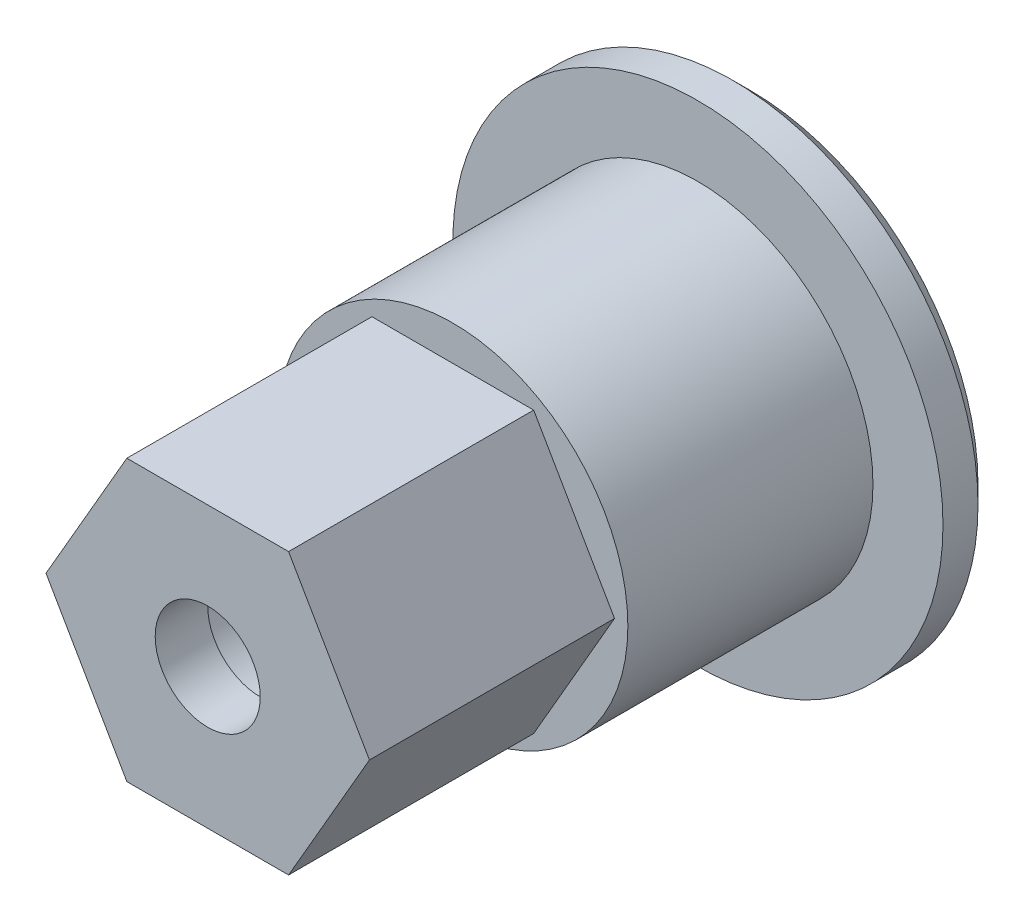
from build123d import *

# Parameters (mm, degrees)
ESQUISSE2_R             = 14
ESQUISSE2_R_2           = 3
RONDIN_28_PERC_6_DEPTH  = 31
ESQUISSE3_OUTSIDE_W     = 40.058
ESQUISSE3_OUTSIDE_H     = 40.058
ESQUISSE3_OUTSIDE_R     = 10
CHARIOTAGE_20_DEPTH     = 28
ESQUISSE5_OUTSIDE_W     = 40.058
ESQUISSE5_OUTSIDE_H     = 40.058
HEXAGONE_DEPTH          = 14
ESQUISSE6_R             = 4.05
ENL_V_MAT_EXTRU_4_DEPTH = 28
CHANFREIN1_SIZE         = 1


with BuildPart() as part:
    # Esquisse2 → rondin 28 perc_ 6 (new body)
    with BuildSketch(Plane.XY):
        Circle(ESQUISSE2_R)
        with Locations(Location((0, 0, 0), (0, 0, 180))):
            Circle(ESQUISSE2_R_2, mode=Mode.SUBTRACT)
    extrude(amount=RONDIN_28_PERC_6_DEPTH)

    # Esquisse3 outside → chariotage 20 (cut)
    with BuildSketch(Plane.XY.offset(31)):
        Rectangle(ESQUISSE3_OUTSIDE_W, ESQUISSE3_OUTSIDE_H)
        Circle(ESQUISSE3_OUTSIDE_R, mode=Mode.SUBTRACT)
    extrude(amount=-CHARIOTAGE_20_DEPTH, mode=Mode.SUBTRACT)

    # Esquisse5 outside → hexagone (cut)
    with BuildSketch(Plane.XY.offset(31)):
        Rectangle(ESQUISSE5_OUTSIDE_W, ESQUISSE5_OUTSIDE_H)
        Polygon((-4.618802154, -8), (4.618802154, -8), (9.237604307, 0), (4.618802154, 8), (-4.618802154, 8), (-9.237604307, 0), align=None, mode=Mode.SUBTRACT)
    extrude(amount=-HEXAGONE_DEPTH, mode=Mode.SUBTRACT)

    # Esquisse6 → Enl_v. mat.-Extru.4 (cut)
    with BuildSketch(Plane(origin=(0, 0, 0), x_dir=(-1, 0, 0), z_dir=(0, 0, -1))):
        Circle(ESQUISSE6_R)
    extrude(amount=-ENL_V_MAT_EXTRU_4_DEPTH, mode=Mode.SUBTRACT)

    # Chanfrein1
    chanfrein1_edges = [part.edges().sort_by_distance(p)[0] for p in [
        (-14, 0, 0),
        (4.05, 0, 0),
    ]]
    chamfer(chanfrein1_edges, length=CHANFREIN1_SIZE)


solid = part.part
